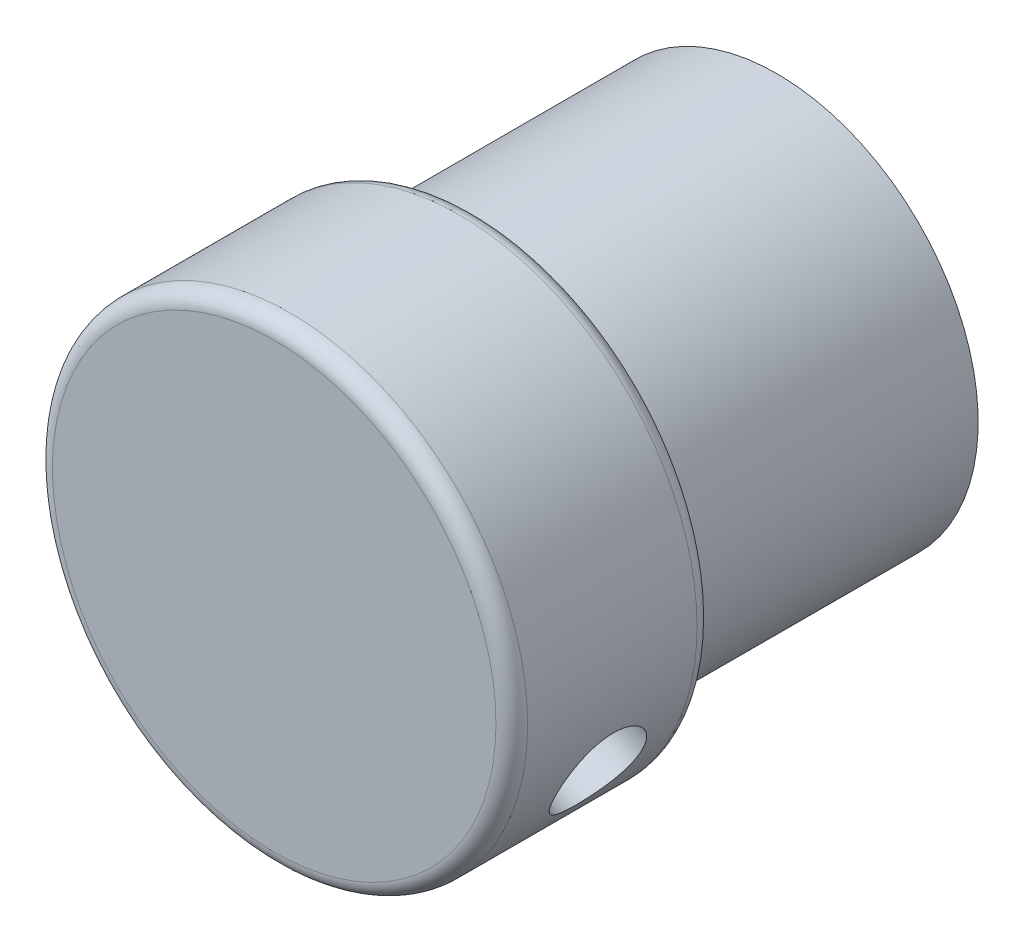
from build123d import *

# Parameters (mm, degrees)
SKETCH1_R                   = 12.7
BASE_EXTRUDE_DEPTH          = 19.05
SKETCH2_R                   = 15
BOSS_EXTRUDE1_DEPTH         = 12.7
F_1_4_20_TAPPED_HOLE1_D     = 5.1054
F_1_4_20_TAPPED_HOLE1_DEPTH = 19.05
F_1_4_20_TAPPED_HOLE1_TIP   = 1.533816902
FILLET1_R                   = 1
SKETCH6_R                   = 2.836753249
CUT_EXTRUDE1_DEPTH          = 44.493071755


with BuildPart() as part:
    # Sketch1 → Base-Extrude (new body)
    with BuildSketch(Plane.XY):
        with Locations(Location((102.39184178, 82.509272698, 0), (0, 0, 180))):
            Circle(SKETCH1_R)
    extrude(amount=BASE_EXTRUDE_DEPTH)

    # Sketch2 → Boss-Extrude1 (add)
    with BuildSketch(Plane.XY.offset(19.05)):
        with Locations((102.39184178, 82.509272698)):
            Circle(SKETCH2_R)
    extrude(amount=BOSS_EXTRUDE1_DEPTH)

    # 1_4-20 Tapped Hole1
    with Locations(Plane(origin=(0, 0, 0), x_dir=(-1, 0, 0), z_dir=(0, 0, -1))):
        with Locations((-102.39184178, 82.509272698)):
            Hole(F_1_4_20_TAPPED_HOLE1_D / 2, depth=F_1_4_20_TAPPED_HOLE1_DEPTH)
            with Locations((0, 0, -(F_1_4_20_TAPPED_HOLE1_DEPTH + F_1_4_20_TAPPED_HOLE1_TIP / 2))):  # 118° drill point
                Cone(0, F_1_4_20_TAPPED_HOLE1_D / 2, F_1_4_20_TAPPED_HOLE1_TIP, mode=Mode.SUBTRACT)

    # Fillet1
    fillet1_edges = [part.edges().sort_by_distance(p)[0] for p in [
        (115.09184178, 82.509272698, 19.05),
        (87.39184178, 82.509272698, 19.05),
        (87.39184178, 82.509272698, 31.75),
    ]]
    fillet(fillet1_edges, radius=FILLET1_R)

    # Sketch6 → Cut-Extrude1 (cut, through all)
    with BuildSketch(Plane(origin=(115.997316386, 76.193335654, 24.879809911), x_dir=(0, 0, -1), z_dir=(0.9070316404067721, -0.42106246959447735, 0))):
        with Locations(Location((0, 0, 0), (0, 0, 90))):
            Circle(SKETCH6_R)
    extrude(amount=-CUT_EXTRUDE1_DEPTH, mode=Mode.SUBTRACT)


solid = part.part
